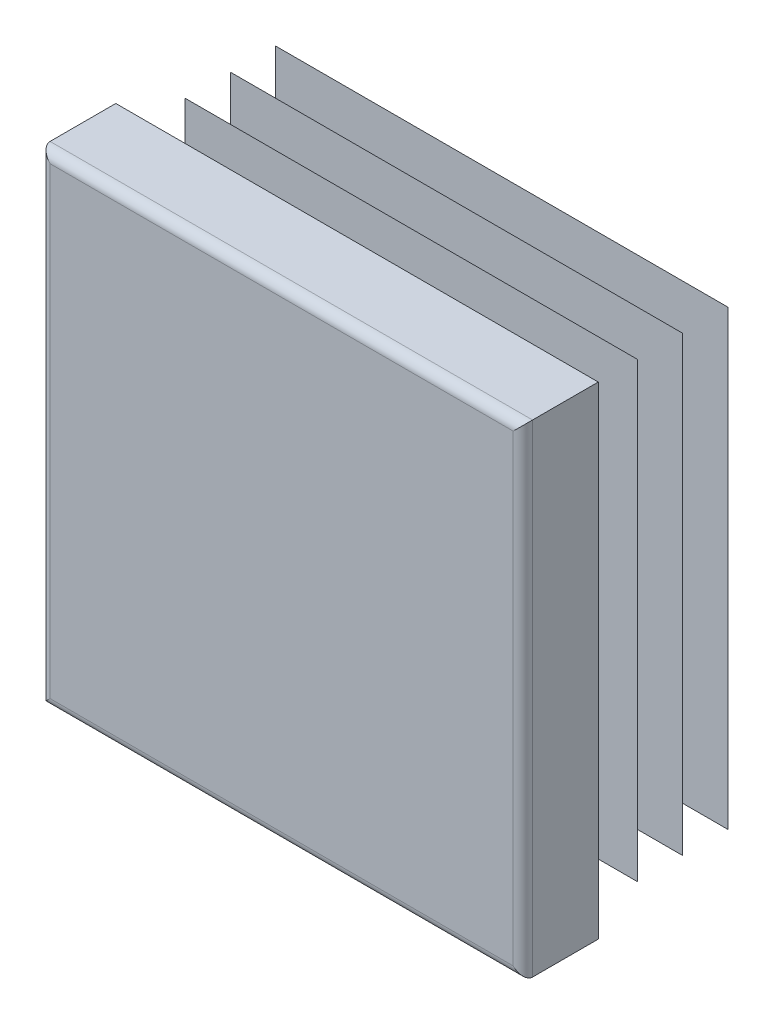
ISO-10303-21;
HEADER;
FILE_DESCRIPTION(('STEP AP214'),'2;1');
FILE_NAME('part.step','',(''),(''),'','','');
FILE_SCHEMA(('AUTOMOTIVE_DESIGN { 1 0 10303 214 1 1 1 1 }'));
ENDSEC;
DATA;
#1=APPLICATION_CONTEXT('core data for automotive mechanical design processes');
#2=APPLICATION_PROTOCOL_DEFINITION('international standard','automotive_design',2000,#1);
#3=PRODUCT_CONTEXT('',#1,'mechanical');
#4=PRODUCT('Part','Part','',(#3));
#5=PRODUCT_RELATED_PRODUCT_CATEGORY('part','',(#4));
#6=PRODUCT_DEFINITION_FORMATION('','',#4);
#7=PRODUCT_DEFINITION_CONTEXT('part definition',#1,'design');
#8=PRODUCT_DEFINITION('design','',#6,#7);
#9=PRODUCT_DEFINITION_SHAPE('','',#8);
#10=(LENGTH_UNIT() NAMED_UNIT(*) SI_UNIT(.MILLI.,.METRE.));
#11=(NAMED_UNIT(*) PLANE_ANGLE_UNIT() SI_UNIT($,.RADIAN.));
#12=(NAMED_UNIT(*) SI_UNIT($,.STERADIAN.) SOLID_ANGLE_UNIT());
#13=UNCERTAINTY_MEASURE_WITH_UNIT(LENGTH_MEASURE(1.E-05),#10,'distance_accuracy_value','');
#14=(GEOMETRIC_REPRESENTATION_CONTEXT(3) GLOBAL_UNCERTAINTY_ASSIGNED_CONTEXT((#13)) GLOBAL_UNIT_ASSIGNED_CONTEXT((#10,
#11,#12)) REPRESENTATION_CONTEXT('',''));
#15=CARTESIAN_POINT('',(0.,0.,0.));
#16=DIRECTION('',(0.,0.,1.));
#17=DIRECTION('',(1.,0.,0.));
#18=AXIS2_PLACEMENT_3D('',#15,#16,#17);
#19=CARTESIAN_POINT('',(15.36,-16.,5.));
#20=DIRECTION('',(0.,0.,-1.));
#21=DIRECTION('',(0.,1.,0.));
#22=AXIS2_PLACEMENT_3D('',#19,#20,#21);
#23=PLANE('',#22);
#24=DIRECTION('',(0.,1.,0.));
#25=VECTOR('',#24,1.);
#26=CARTESIAN_POINT('',(-15.36,-16.,5.));
#27=LINE('',#26,#25);
#28=CARTESIAN_POINT('',(-15.36,-15.36,5.));
#29=VERTEX_POINT('',#28);
#30=CARTESIAN_POINT('',(-15.36,15.36,5.));
#31=VERTEX_POINT('',#30);
#32=EDGE_CURVE('E262',#29,#31,#27,.T.);
#33=ORIENTED_EDGE('',*,*,#32,.F.);
#34=DIRECTION('',(-1.,0.,0.));
#35=VECTOR('',#34,1.);
#36=CARTESIAN_POINT('',(16.,-15.36,5.));
#37=LINE('',#36,#35);
#38=CARTESIAN_POINT('',(15.36,-15.36,5.));
#39=VERTEX_POINT('',#38);
#40=EDGE_CURVE('E432',#39,#29,#37,.T.);
#41=ORIENTED_EDGE('',*,*,#40,.F.);
#42=DIRECTION('',(0.,1.,0.));
#43=VECTOR('',#42,1.);
#44=CARTESIAN_POINT('',(15.36,-16.,5.));
#45=LINE('',#44,#43);
#46=CARTESIAN_POINT('',(15.36,15.36,5.));
#47=VERTEX_POINT('',#46);
#48=EDGE_CURVE('E257',#39,#47,#45,.T.);
#49=ORIENTED_EDGE('',*,*,#48,.T.);
#50=DIRECTION('',(-1.,0.,0.));
#51=VECTOR('',#50,1.);
#52=CARTESIAN_POINT('',(16.,15.36,5.));
#53=LINE('',#52,#51);
#54=EDGE_CURVE('E534',#47,#31,#53,.T.);
#55=ORIENTED_EDGE('',*,*,#54,.T.);
#56=EDGE_LOOP('',(#33,#41,#49,#55));
#57=FACE_BOUND('',#56,.T.);
#58=ADVANCED_FACE('F14',(#57),#23,.F.);
#59=CARTESIAN_POINT('',(-15.36,-16.,4.36));
#60=DIRECTION('',(0.,1.,0.));
#61=DIRECTION('',(-1.,0.,0.));
#62=AXIS2_PLACEMENT_3D('',#59,#60,#61);
#63=CYLINDRICAL_SURFACE('',#62,0.64);
#64=DIRECTION('',(0.,1.,0.));
#65=VECTOR('',#64,1.);
#66=CARTESIAN_POINT('',(-16.,-16.,4.36));
#67=LINE('',#66,#65);
#68=CARTESIAN_POINT('',(-16.,-16.,4.36));
#69=VERTEX_POINT('',#68);
#70=CARTESIAN_POINT('',(-16.,16.,4.36));
#71=VERTEX_POINT('',#70);
#72=EDGE_CURVE('E354',#69,#71,#67,.T.);
#73=ORIENTED_EDGE('',*,*,#72,.F.);
#74=CARTESIAN_POINT('',(-15.36,-15.36,4.36));
#75=DIRECTION('',(-0.707106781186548,0.707106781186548,0.));
#76=DIRECTION('',(0.707106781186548,0.707106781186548,0.));
#77=AXIS2_PLACEMENT_3D('',#74,#75,#76);
#78=ELLIPSE('',#77,0.905096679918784,0.64);
#79=EDGE_CURVE('E59',#69,#29,#78,.T.);
#80=ORIENTED_EDGE('',*,*,#79,.T.);
#81=ORIENTED_EDGE('',*,*,#32,.T.);
#82=CARTESIAN_POINT('',(-15.36,15.36,4.36));
#83=DIRECTION('',(0.707106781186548,0.707106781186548,0.));
#84=DIRECTION('',(-0.707106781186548,0.707106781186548,0.));
#85=AXIS2_PLACEMENT_3D('',#82,#83,#84);
#86=ELLIPSE('',#85,0.905096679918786,0.64);
#87=EDGE_CURVE('E258',#31,#71,#86,.F.);
#88=ORIENTED_EDGE('',*,*,#87,.T.);
#89=EDGE_LOOP('',(#73,#80,#81,#88));
#90=FACE_BOUND('',#89,.T.);
#91=ADVANCED_FACE('F16',(#90),#63,.T.);
#92=CARTESIAN_POINT('',(-16.,-16.,4.36));
#93=DIRECTION('',(1.,0.,0.));
#94=DIRECTION('',(0.,1.,0.));
#95=AXIS2_PLACEMENT_3D('',#92,#93,#94);
#96=PLANE('',#95);
#97=DIRECTION('',(0.,0.,-1.));
#98=VECTOR('',#97,1.);
#99=CARTESIAN_POINT('',(-16.,16.,4.36));
#100=LINE('',#99,#98);
#101=CARTESIAN_POINT('',(-16.,16.,0.));
#102=VERTEX_POINT('',#101);
#103=EDGE_CURVE('E519',#71,#102,#100,.T.);
#104=ORIENTED_EDGE('',*,*,#103,.T.);
#105=DIRECTION('',(0.,1.,0.));
#106=VECTOR('',#105,1.);
#107=CARTESIAN_POINT('',(-16.,-16.,0.));
#108=LINE('',#107,#106);
#109=CARTESIAN_POINT('',(-16.,-16.,0.));
#110=VERTEX_POINT('',#109);
#111=EDGE_CURVE('E352',#110,#102,#108,.T.);
#112=ORIENTED_EDGE('',*,*,#111,.F.);
#113=DIRECTION('',(0.,0.,-1.));
#114=VECTOR('',#113,1.);
#115=CARTESIAN_POINT('',(-16.,-16.,4.36));
#116=LINE('',#115,#114);
#117=EDGE_CURVE('E520',#69,#110,#116,.T.);
#118=ORIENTED_EDGE('',*,*,#117,.F.);
#119=ORIENTED_EDGE('',*,*,#72,.T.);
#120=EDGE_LOOP('',(#104,#112,#118,#119));
#121=FACE_BOUND('',#120,.T.);
#122=ADVANCED_FACE('F604',(#121),#96,.F.);
#123=CARTESIAN_POINT('',(-12.,-16.,0.));
#124=DIRECTION('',(1.,0.,0.));
#125=DIRECTION('',(0.,1.,0.));
#126=AXIS2_PLACEMENT_3D('',#123,#124,#125);
#127=PLANE('',#126);
#128=DIRECTION('',(0.,1.,0.));
#129=VECTOR('',#128,1.);
#130=CARTESIAN_POINT('',(-12.,-16.,0.));
#131=LINE('',#130,#129);
#132=CARTESIAN_POINT('',(-12.,-12.,0.));
#133=VERTEX_POINT('',#132);
#134=CARTESIAN_POINT('',(-12.,12.,0.));
#135=VERTEX_POINT('',#134);
#136=EDGE_CURVE('E349',#133,#135,#131,.T.);
#137=ORIENTED_EDGE('',*,*,#136,.T.);
#138=DIRECTION('',(0.,0.,-1.));
#139=VECTOR('',#138,1.);
#140=CARTESIAN_POINT('',(-12.,12.,0.));
#141=LINE('',#140,#139);
#142=CARTESIAN_POINT('',(-12.,12.,-0.6));
#143=VERTEX_POINT('',#142);
#144=EDGE_CURVE('E445',#135,#143,#141,.T.);
#145=ORIENTED_EDGE('',*,*,#144,.T.);
#146=DIRECTION('',(0.,1.,0.));
#147=VECTOR('',#146,1.);
#148=CARTESIAN_POINT('',(-12.,-16.,-0.6));
#149=LINE('',#148,#147);
#150=CARTESIAN_POINT('',(-12.,-12.,-0.6));
#151=VERTEX_POINT('',#150);
#152=EDGE_CURVE('E346',#151,#143,#149,.T.);
#153=ORIENTED_EDGE('',*,*,#152,.F.);
#154=DIRECTION('',(0.,0.,1.));
#155=VECTOR('',#154,1.);
#156=CARTESIAN_POINT('',(-12.,-12.,0.));
#157=LINE('',#156,#155);
#158=EDGE_CURVE('E439',#151,#133,#157,.T.);
#159=ORIENTED_EDGE('',*,*,#158,.T.);
#160=EDGE_LOOP('',(#137,#145,#153,#159));
#161=FACE_BOUND('',#160,.T.);
#162=ADVANCED_FACE('F728',(#161),#127,.F.);
#163=CARTESIAN_POINT('',(-15.,-16.,-0.6));
#164=DIRECTION('',(0.573576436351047,0.,0.819152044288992));
#165=DIRECTION('',(-0.819152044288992,0.,0.573576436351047));
#166=AXIS2_PLACEMENT_3D('',#163,#164,#165);
#167=PLANE('',#166);
#168=DIRECTION('',(0.,1.,0.));
#169=VECTOR('',#168,1.);
#170=CARTESIAN_POINT('',(-15.,-16.,-0.6));
#171=LINE('',#170,#169);
#172=CARTESIAN_POINT('',(-15.,-15.,-0.6));
#173=VERTEX_POINT('',#172);
#174=CARTESIAN_POINT('',(-15.,15.,-0.6));
#175=VERTEX_POINT('',#174);
#176=EDGE_CURVE('E344',#173,#175,#171,.T.);
#177=ORIENTED_EDGE('',*,*,#176,.T.);
#178=DIRECTION('',(0.633687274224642,-0.633687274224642,-0.443712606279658));
#179=VECTOR('',#178,1.);
#180=CARTESIAN_POINT('',(-2.55165359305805,2.55165359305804,-9.31642599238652));
#181=LINE('',#180,#179);
#182=CARTESIAN_POINT('',(-12.,12.,-2.70062261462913));
#183=VERTEX_POINT('',#182);
#184=EDGE_CURVE('E457',#175,#183,#181,.T.);
#185=ORIENTED_EDGE('',*,*,#184,.T.);
#186=DIRECTION('',(0.,1.,0.));
#187=VECTOR('',#186,1.);
#188=CARTESIAN_POINT('',(-12.,-16.,-2.70062261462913));
#189=LINE('',#188,#187);
#190=CARTESIAN_POINT('',(-12.,-12.,-2.70062261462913));
#191=VERTEX_POINT('',#190);
#192=EDGE_CURVE('E341',#191,#183,#189,.T.);
#193=ORIENTED_EDGE('',*,*,#192,.F.);
#194=DIRECTION('',(-0.633687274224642,-0.633687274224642,0.443712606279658));
#195=VECTOR('',#194,1.);
#196=CARTESIAN_POINT('',(-15.4015595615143,-15.4015595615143,-0.31882496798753));
#197=LINE('',#196,#195);
#198=EDGE_CURVE('E451',#191,#173,#197,.T.);
#199=ORIENTED_EDGE('',*,*,#198,.T.);
#200=EDGE_LOOP('',(#177,#185,#193,#199));
#201=FACE_BOUND('',#200,.T.);
#202=ADVANCED_FACE('F732',(#201),#167,.F.);
#203=CARTESIAN_POINT('',(-12.,-16.,-2.70062261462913));
#204=DIRECTION('',(1.,0.,0.));
#205=DIRECTION('',(0.,1.,0.));
#206=AXIS2_PLACEMENT_3D('',#203,#204,#205);
#207=PLANE('',#206);
#208=ORIENTED_EDGE('',*,*,#192,.T.);
#209=DIRECTION('',(0.,0.,-1.));
#210=VECTOR('',#209,1.);
#211=CARTESIAN_POINT('',(-12.,12.,-2.70062261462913));
#212=LINE('',#211,#210);
#213=CARTESIAN_POINT('',(-12.,12.,-3.6));
#214=VERTEX_POINT('',#213);
#215=EDGE_CURVE('E463',#183,#214,#212,.T.);
#216=ORIENTED_EDGE('',*,*,#215,.T.);
#217=DIRECTION('',(0.,1.,0.));
#218=VECTOR('',#217,1.);
#219=CARTESIAN_POINT('',(-12.,-16.,-3.6));
#220=LINE('',#219,#218);
#221=CARTESIAN_POINT('',(-12.,-12.,-3.6));
#222=VERTEX_POINT('',#221);
#223=EDGE_CURVE('E338',#222,#214,#220,.T.);
#224=ORIENTED_EDGE('',*,*,#223,.F.);
#225=DIRECTION('',(0.,0.,1.));
#226=VECTOR('',#225,1.);
#227=CARTESIAN_POINT('',(-12.,-12.,-2.70062261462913));
#228=LINE('',#227,#226);
#229=EDGE_CURVE('E460',#222,#191,#228,.T.);
#230=ORIENTED_EDGE('',*,*,#229,.T.);
#231=EDGE_LOOP('',(#208,#216,#224,#230));
#232=FACE_BOUND('',#231,.T.);
#233=ADVANCED_FACE('F738',(#232),#207,.F.);
#234=CARTESIAN_POINT('',(-15.,-16.,-3.6));
#235=DIRECTION('',(0.573576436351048,0.,0.819152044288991));
#236=DIRECTION('',(-0.819152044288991,0.,0.573576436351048));
#237=AXIS2_PLACEMENT_3D('',#234,#235,#236);
#238=PLANE('',#237);
#239=DIRECTION('',(0.,1.,0.));
#240=VECTOR('',#239,1.);
#241=CARTESIAN_POINT('',(-15.,-16.,-3.6));
#242=LINE('',#241,#240);
#243=CARTESIAN_POINT('',(-15.,-15.,-3.6));
#244=VERTEX_POINT('',#243);
#245=CARTESIAN_POINT('',(-15.,15.,-3.6));
#246=VERTEX_POINT('',#245);
#247=EDGE_CURVE('E336',#244,#246,#242,.T.);
#248=ORIENTED_EDGE('',*,*,#247,.T.);
#249=DIRECTION('',(0.633687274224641,-0.633687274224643,-0.443712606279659));
#250=VECTOR('',#249,1.);
#251=CARTESIAN_POINT('',(-2.55165359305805,2.55165359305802,-12.3164259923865));
#252=LINE('',#251,#250);
#253=CARTESIAN_POINT('',(-12.,12.,-5.70062261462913));
#254=VERTEX_POINT('',#253);
#255=EDGE_CURVE('E475',#246,#254,#252,.T.);
#256=ORIENTED_EDGE('',*,*,#255,.T.);
#257=DIRECTION('',(0.,1.,0.));
#258=VECTOR('',#257,1.);
#259=CARTESIAN_POINT('',(-12.,-16.,-5.70062261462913));
#260=LINE('',#259,#258);
#261=CARTESIAN_POINT('',(-12.,-12.,-5.70062261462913));
#262=VERTEX_POINT('',#261);
#263=EDGE_CURVE('E333',#262,#254,#260,.T.);
#264=ORIENTED_EDGE('',*,*,#263,.F.);
#265=DIRECTION('',(-0.633687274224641,-0.633687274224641,0.44371260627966));
#266=VECTOR('',#265,1.);
#267=CARTESIAN_POINT('',(-15.4015595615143,-15.4015595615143,-3.31882496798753));
#268=LINE('',#267,#266);
#269=EDGE_CURVE('E469',#262,#244,#268,.T.);
#270=ORIENTED_EDGE('',*,*,#269,.T.);
#271=EDGE_LOOP('',(#248,#256,#264,#270));
#272=FACE_BOUND('',#271,.T.);
#273=ADVANCED_FACE('F742',(#272),#238,.F.);
#274=CARTESIAN_POINT('',(-12.,-16.,-5.70062261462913));
#275=DIRECTION('',(1.,0.,0.));
#276=DIRECTION('',(0.,1.,0.));
#277=AXIS2_PLACEMENT_3D('',#274,#275,#276);
#278=PLANE('',#277);
#279=ORIENTED_EDGE('',*,*,#263,.T.);
#280=DIRECTION('',(0.,0.,-1.));
#281=VECTOR('',#280,1.);
#282=CARTESIAN_POINT('',(-12.,12.,-5.70062261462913));
#283=LINE('',#282,#281);
#284=CARTESIAN_POINT('',(-12.,12.,-6.6));
#285=VERTEX_POINT('',#284);
#286=EDGE_CURVE('E481',#254,#285,#283,.T.);
#287=ORIENTED_EDGE('',*,*,#286,.T.);
#288=DIRECTION('',(0.,1.,0.));
#289=VECTOR('',#288,1.);
#290=CARTESIAN_POINT('',(-12.,-16.,-6.6));
#291=LINE('',#290,#289);
#292=CARTESIAN_POINT('',(-12.,-12.,-6.6));
#293=VERTEX_POINT('',#292);
#294=EDGE_CURVE('E330',#293,#285,#291,.T.);
#295=ORIENTED_EDGE('',*,*,#294,.F.);
#296=DIRECTION('',(0.,0.,1.));
#297=VECTOR('',#296,1.);
#298=CARTESIAN_POINT('',(-12.,-12.,-5.70062261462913));
#299=LINE('',#298,#297);
#300=EDGE_CURVE('E478',#293,#262,#299,.T.);
#301=ORIENTED_EDGE('',*,*,#300,.T.);
#302=EDGE_LOOP('',(#279,#287,#295,#301));
#303=FACE_BOUND('',#302,.T.);
#304=ADVANCED_FACE('F746',(#303),#278,.F.);
#305=CARTESIAN_POINT('',(-15.,-16.,-6.6));
#306=DIRECTION('',(0.573576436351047,0.,0.819152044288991));
#307=DIRECTION('',(-0.819152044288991,0.,0.573576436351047));
#308=AXIS2_PLACEMENT_3D('',#305,#306,#307);
#309=PLANE('',#308);
#310=DIRECTION('',(0.,1.,0.));
#311=VECTOR('',#310,1.);
#312=CARTESIAN_POINT('',(-15.,-16.,-6.6));
#313=LINE('',#312,#311);
#314=CARTESIAN_POINT('',(-15.,-15.,-6.6));
#315=VERTEX_POINT('',#314);
#316=CARTESIAN_POINT('',(-15.,15.,-6.6));
#317=VERTEX_POINT('',#316);
#318=EDGE_CURVE('E328',#315,#317,#313,.T.);
#319=ORIENTED_EDGE('',*,*,#318,.T.);
#320=DIRECTION('',(0.633687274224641,-0.633687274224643,-0.443712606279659));
#321=VECTOR('',#320,1.);
#322=CARTESIAN_POINT('',(-2.55165359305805,2.55165359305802,-15.3164259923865));
#323=LINE('',#322,#321);
#324=CARTESIAN_POINT('',(-12.,12.,-8.70062261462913));
#325=VERTEX_POINT('',#324);
#326=EDGE_CURVE('E493',#317,#325,#323,.T.);
#327=ORIENTED_EDGE('',*,*,#326,.T.);
#328=DIRECTION('',(0.,1.,0.));
#329=VECTOR('',#328,1.);
#330=CARTESIAN_POINT('',(-12.,-16.,-8.70062261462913));
#331=LINE('',#330,#329);
#332=CARTESIAN_POINT('',(-12.,-12.,-8.70062261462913));
#333=VERTEX_POINT('',#332);
#334=EDGE_CURVE('E325',#333,#325,#331,.T.);
#335=ORIENTED_EDGE('',*,*,#334,.F.);
#336=DIRECTION('',(-0.633687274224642,-0.633687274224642,0.443712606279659));
#337=VECTOR('',#336,1.);
#338=CARTESIAN_POINT('',(-15.4015595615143,-15.4015595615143,-6.31882496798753));
#339=LINE('',#338,#337);
#340=EDGE_CURVE('E487',#333,#315,#339,.T.);
#341=ORIENTED_EDGE('',*,*,#340,.T.);
#342=EDGE_LOOP('',(#319,#327,#335,#341));
#343=FACE_BOUND('',#342,.T.);
#344=ADVANCED_FACE('F668',(#343),#309,.F.);
#345=CARTESIAN_POINT('',(-12.,-16.,-8.70062261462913));
#346=DIRECTION('',(1.,0.,0.));
#347=DIRECTION('',(0.,1.,0.));
#348=AXIS2_PLACEMENT_3D('',#345,#346,#347);
#349=PLANE('',#348);
#350=ORIENTED_EDGE('',*,*,#334,.T.);
#351=DIRECTION('',(0.,0.,-1.));
#352=VECTOR('',#351,1.);
#353=CARTESIAN_POINT('',(-12.,12.,-8.70062261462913));
#354=LINE('',#353,#352);
#355=CARTESIAN_POINT('',(-12.,12.,-9.6));
#356=VERTEX_POINT('',#355);
#357=EDGE_CURVE('E499',#325,#356,#354,.T.);
#358=ORIENTED_EDGE('',*,*,#357,.T.);
#359=DIRECTION('',(0.,1.,0.));
#360=VECTOR('',#359,1.);
#361=CARTESIAN_POINT('',(-12.,-16.,-9.6));
#362=LINE('',#361,#360);
#363=CARTESIAN_POINT('',(-12.,-12.,-9.6));
#364=VERTEX_POINT('',#363);
#365=EDGE_CURVE('E322',#364,#356,#362,.T.);
#366=ORIENTED_EDGE('',*,*,#365,.F.);
#367=DIRECTION('',(0.,0.,1.));
#368=VECTOR('',#367,1.);
#369=CARTESIAN_POINT('',(-12.,-12.,-8.70062261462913));
#370=LINE('',#369,#368);
#371=EDGE_CURVE('E496',#364,#333,#370,.T.);
#372=ORIENTED_EDGE('',*,*,#371,.T.);
#373=EDGE_LOOP('',(#350,#358,#366,#372));
#374=FACE_BOUND('',#373,.T.);
#375=ADVANCED_FACE('F665',(#374),#349,.F.);
#376=CARTESIAN_POINT('',(-15.,-16.,-9.6));
#377=DIRECTION('',(0.573576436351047,0.,0.819152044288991));
#378=DIRECTION('',(-0.819152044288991,0.,0.573576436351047));
#379=AXIS2_PLACEMENT_3D('',#376,#377,#378);
#380=PLANE('',#379);
#381=DIRECTION('',(0.,1.,0.));
#382=VECTOR('',#381,1.);
#383=CARTESIAN_POINT('',(-15.,-16.,-9.6));
#384=LINE('',#383,#382);
#385=CARTESIAN_POINT('',(-15.,-15.,-9.6));
#386=VERTEX_POINT('',#385);
#387=CARTESIAN_POINT('',(-15.,15.,-9.6));
#388=VERTEX_POINT('',#387);
#389=EDGE_CURVE('E320',#386,#388,#384,.T.);
#390=ORIENTED_EDGE('',*,*,#389,.T.);
#391=DIRECTION('',(0.633687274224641,-0.633687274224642,-0.443712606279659));
#392=VECTOR('',#391,1.);
#393=CARTESIAN_POINT('',(-2.55165359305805,2.55165359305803,-18.3164259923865));
#394=LINE('',#393,#392);
#395=CARTESIAN_POINT('',(-12.,12.,-11.7006226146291));
#396=VERTEX_POINT('',#395);
#397=EDGE_CURVE('E511',#388,#396,#394,.T.);
#398=ORIENTED_EDGE('',*,*,#397,.T.);
#399=DIRECTION('',(0.,1.,0.));
#400=VECTOR('',#399,1.);
#401=CARTESIAN_POINT('',(-12.,-16.,-11.7006226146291));
#402=LINE('',#401,#400);
#403=CARTESIAN_POINT('',(-12.,-12.,-11.7006226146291));
#404=VERTEX_POINT('',#403);
#405=EDGE_CURVE('E317',#404,#396,#402,.T.);
#406=ORIENTED_EDGE('',*,*,#405,.F.);
#407=DIRECTION('',(-0.633687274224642,-0.633687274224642,0.443712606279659));
#408=VECTOR('',#407,1.);
#409=CARTESIAN_POINT('',(-15.4015595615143,-15.4015595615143,-9.31882496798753));
#410=LINE('',#409,#408);
#411=EDGE_CURVE('E505',#404,#386,#410,.T.);
#412=ORIENTED_EDGE('',*,*,#411,.T.);
#413=EDGE_LOOP('',(#390,#398,#406,#412));
#414=FACE_BOUND('',#413,.T.);
#415=ADVANCED_FACE('F580',(#414),#380,.F.);
#416=CARTESIAN_POINT('',(-12.,-16.,-11.7006226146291));
#417=DIRECTION('',(1.,0.,0.));
#418=DIRECTION('',(0.,1.,0.));
#419=AXIS2_PLACEMENT_3D('',#416,#417,#418);
#420=PLANE('',#419);
#421=ORIENTED_EDGE('',*,*,#405,.T.);
#422=DIRECTION('',(0.,0.,-1.));
#423=VECTOR('',#422,1.);
#424=CARTESIAN_POINT('',(-12.,12.,-11.7006226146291));
#425=LINE('',#424,#423);
#426=CARTESIAN_POINT('',(-12.,12.,-12.));
#427=VERTEX_POINT('',#426);
#428=EDGE_CURVE('E517',#396,#427,#425,.T.);
#429=ORIENTED_EDGE('',*,*,#428,.T.);
#430=DIRECTION('',(0.,1.,0.));
#431=VECTOR('',#430,1.);
#432=CARTESIAN_POINT('',(-12.,-16.,-12.));
#433=LINE('',#432,#431);
#434=CARTESIAN_POINT('',(-12.,-12.,-12.));
#435=VERTEX_POINT('',#434);
#436=EDGE_CURVE('E314',#435,#427,#433,.T.);
#437=ORIENTED_EDGE('',*,*,#436,.F.);
#438=DIRECTION('',(0.,0.,1.));
#439=VECTOR('',#438,1.);
#440=CARTESIAN_POINT('',(-12.,-12.,-11.7006226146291));
#441=LINE('',#440,#439);
#442=EDGE_CURVE('E514',#435,#404,#441,.T.);
#443=ORIENTED_EDGE('',*,*,#442,.T.);
#444=EDGE_LOOP('',(#421,#429,#437,#443));
#445=FACE_BOUND('',#444,.T.);
#446=ADVANCED_FACE('F582',(#445),#420,.F.);
#447=CARTESIAN_POINT('',(-12.,-16.,-12.));
#448=DIRECTION('',(0.,0.,1.));
#449=DIRECTION('',(0.,-1.,0.));
#450=AXIS2_PLACEMENT_3D('',#447,#448,#449);
#451=PLANE('',#450);
#452=ORIENTED_EDGE('',*,*,#436,.T.);
#453=DIRECTION('',(-1.,0.,0.));
#454=VECTOR('',#453,1.);
#455=CARTESIAN_POINT('',(16.,12.,-12.));
#456=LINE('',#455,#454);
#457=CARTESIAN_POINT('',(12.,12.,-12.));
#458=VERTEX_POINT('',#457);
#459=EDGE_CURVE('E388',#458,#427,#456,.T.);
#460=ORIENTED_EDGE('',*,*,#459,.F.);
#461=DIRECTION('',(0.,1.,0.));
#462=VECTOR('',#461,1.);
#463=CARTESIAN_POINT('',(12.,-16.,-12.));
#464=LINE('',#463,#462);
#465=CARTESIAN_POINT('',(12.,-12.,-12.));
#466=VERTEX_POINT('',#465);
#467=EDGE_CURVE('E311',#466,#458,#464,.T.);
#468=ORIENTED_EDGE('',*,*,#467,.F.);
#469=DIRECTION('',(-1.,0.,0.));
#470=VECTOR('',#469,1.);
#471=CARTESIAN_POINT('',(16.,-12.,-12.));
#472=LINE('',#471,#470);
#473=EDGE_CURVE('E386',#466,#435,#472,.T.);
#474=ORIENTED_EDGE('',*,*,#473,.T.);
#475=EDGE_LOOP('',(#452,#460,#468,#474));
#476=FACE_BOUND('',#475,.T.);
#477=ADVANCED_FACE('F385',(#476),#451,.F.);
#478=CARTESIAN_POINT('',(12.,-16.,-12.));
#479=DIRECTION('',(-1.,0.,0.));
#480=DIRECTION('',(0.,-1.,0.));
#481=AXIS2_PLACEMENT_3D('',#478,#479,#480);
#482=PLANE('',#481);
#483=ORIENTED_EDGE('',*,*,#467,.T.);
#484=DIRECTION('',(0.,0.,1.));
#485=VECTOR('',#484,1.);
#486=CARTESIAN_POINT('',(12.,12.,-12.));
#487=LINE('',#486,#485);
#488=CARTESIAN_POINT('',(12.,12.,-11.7006226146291));
#489=VERTEX_POINT('',#488);
#490=EDGE_CURVE('E9',#458,#489,#487,.T.);
#491=ORIENTED_EDGE('',*,*,#490,.T.);
#492=DIRECTION('',(0.,1.,0.));
#493=VECTOR('',#492,1.);
#494=CARTESIAN_POINT('',(12.,-16.,-11.7006226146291));
#495=LINE('',#494,#493);
#496=CARTESIAN_POINT('',(12.,-12.,-11.7006226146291));
#497=VERTEX_POINT('',#496);
#498=EDGE_CURVE('E308',#497,#489,#495,.T.);
#499=ORIENTED_EDGE('',*,*,#498,.F.);
#500=DIRECTION('',(0.,0.,-1.));
#501=VECTOR('',#500,1.);
#502=CARTESIAN_POINT('',(12.,-12.,-12.));
#503=LINE('',#502,#501);
#504=EDGE_CURVE('E23',#497,#466,#503,.T.);
#505=ORIENTED_EDGE('',*,*,#504,.T.);
#506=EDGE_LOOP('',(#483,#491,#499,#505));
#507=FACE_BOUND('',#506,.T.);
#508=ADVANCED_FACE('F378',(#507),#482,.F.);
#509=CARTESIAN_POINT('',(12.,-16.,-11.7006226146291));
#510=DIRECTION('',(-0.573576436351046,0.,0.819152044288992));
#511=DIRECTION('',(-0.819152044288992,0.,-0.573576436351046));
#512=AXIS2_PLACEMENT_3D('',#509,#510,#511);
#513=PLANE('',#512);
#514=ORIENTED_EDGE('',*,*,#498,.T.);
#515=DIRECTION('',(0.633687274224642,0.633687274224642,0.443712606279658));
#516=VECTOR('',#515,1.);
#517=CARTESIAN_POINT('',(0.756332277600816,0.756332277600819,-19.5735235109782));
#518=LINE('',#517,#516);
#519=CARTESIAN_POINT('',(15.,15.,-9.6));
#520=VERTEX_POINT('',#519);
#521=EDGE_CURVE('E508',#489,#520,#518,.T.);
#522=ORIENTED_EDGE('',*,*,#521,.T.);
#523=DIRECTION('',(0.,1.,0.));
#524=VECTOR('',#523,1.);
#525=CARTESIAN_POINT('',(15.,-16.,-9.6));
#526=LINE('',#525,#524);
#527=CARTESIAN_POINT('',(15.,-15.,-9.6));
#528=VERTEX_POINT('',#527);
#529=EDGE_CURVE('E305',#528,#520,#526,.T.);
#530=ORIENTED_EDGE('',*,*,#529,.F.);
#531=DIRECTION('',(-0.633687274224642,0.633687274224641,-0.443712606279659));
#532=VECTOR('',#531,1.);
#533=CARTESIAN_POINT('',(13.606238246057,-13.606238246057,-10.5759224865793));
#534=LINE('',#533,#532);
#535=EDGE_CURVE('E502',#528,#497,#534,.T.);
#536=ORIENTED_EDGE('',*,*,#535,.T.);
#537=EDGE_LOOP('',(#514,#522,#530,#536));
#538=FACE_BOUND('',#537,.T.);
#539=ADVANCED_FACE('F588',(#538),#513,.F.);
#540=CARTESIAN_POINT('',(15.,-16.,-9.6));
#541=DIRECTION('',(0.,0.,-1.));
#542=DIRECTION('',(0.,1.,0.));
#543=AXIS2_PLACEMENT_3D('',#540,#541,#542);
#544=PLANE('',#543);
#545=ORIENTED_EDGE('',*,*,#529,.T.);
#546=DIRECTION('',(-1.,0.,0.));
#547=VECTOR('',#546,1.);
#548=CARTESIAN_POINT('',(16.,15.,-9.6));
#549=LINE('',#548,#547);
#550=EDGE_CURVE('E394',#520,#388,#549,.T.);
#551=ORIENTED_EDGE('',*,*,#550,.T.);
#552=ORIENTED_EDGE('',*,*,#389,.F.);
#553=DIRECTION('',(-1.,0.,0.));
#554=VECTOR('',#553,1.);
#555=CARTESIAN_POINT('',(16.,-15.,-9.6));
#556=LINE('',#555,#554);
#557=EDGE_CURVE('E401',#528,#386,#556,.T.);
#558=ORIENTED_EDGE('',*,*,#557,.F.);
#559=EDGE_LOOP('',(#545,#551,#552,#558));
#560=FACE_BOUND('',#559,.T.);
#561=ORIENTED_EDGE('',*,*,#365,.T.);
#562=DIRECTION('',(-1.,0.,0.));
#563=VECTOR('',#562,1.);
#564=CARTESIAN_POINT('',(16.,12.,-9.6));
#565=LINE('',#564,#563);
#566=CARTESIAN_POINT('',(12.,12.,-9.6));
#567=VERTEX_POINT('',#566);
#568=EDGE_CURVE('E567',#567,#356,#565,.T.);
#569=ORIENTED_EDGE('',*,*,#568,.F.);
#570=DIRECTION('',(0.,1.,0.));
#571=VECTOR('',#570,1.);
#572=CARTESIAN_POINT('',(12.,-16.,-9.6));
#573=LINE('',#572,#571);
#574=CARTESIAN_POINT('',(12.,-12.,-9.6));
#575=VERTEX_POINT('',#574);
#576=EDGE_CURVE('E302',#575,#567,#573,.T.);
#577=ORIENTED_EDGE('',*,*,#576,.F.);
#578=DIRECTION('',(-1.,0.,0.));
#579=VECTOR('',#578,1.);
#580=CARTESIAN_POINT('',(16.,-12.,-9.6));
#581=LINE('',#580,#579);
#582=EDGE_CURVE('E403',#575,#364,#581,.T.);
#583=ORIENTED_EDGE('',*,*,#582,.T.);
#584=EDGE_LOOP('',(#561,#569,#577,#583));
#585=FACE_BOUND('',#584,.T.);
#586=ADVANCED_FACE('F571',(#560,#585),#544,.F.);
#587=CARTESIAN_POINT('',(12.,-16.,-9.6));
#588=DIRECTION('',(-1.,0.,0.));
#589=DIRECTION('',(0.,-1.,0.));
#590=AXIS2_PLACEMENT_3D('',#587,#588,#589);
#591=PLANE('',#590);
#592=ORIENTED_EDGE('',*,*,#576,.T.);
#593=DIRECTION('',(0.,0.,1.));
#594=VECTOR('',#593,1.);
#595=CARTESIAN_POINT('',(12.,12.,-9.6));
#596=LINE('',#595,#594);
#597=CARTESIAN_POINT('',(12.,12.,-8.70062261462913));
#598=VERTEX_POINT('',#597);
#599=EDGE_CURVE('E372',#567,#598,#596,.T.);
#600=ORIENTED_EDGE('',*,*,#599,.T.);
#601=DIRECTION('',(0.,1.,0.));
#602=VECTOR('',#601,1.);
#603=CARTESIAN_POINT('',(12.,-16.,-8.70062261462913));
#604=LINE('',#603,#602);
#605=CARTESIAN_POINT('',(12.,-12.,-8.70062261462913));
#606=VERTEX_POINT('',#605);
#607=EDGE_CURVE('E299',#606,#598,#604,.T.);
#608=ORIENTED_EDGE('',*,*,#607,.F.);
#609=DIRECTION('',(0.,0.,-1.));
#610=VECTOR('',#609,1.);
#611=CARTESIAN_POINT('',(12.,-12.,-9.6));
#612=LINE('',#611,#610);
#613=EDGE_CURVE('E369',#606,#575,#612,.T.);
#614=ORIENTED_EDGE('',*,*,#613,.T.);
#615=EDGE_LOOP('',(#592,#600,#608,#614));
#616=FACE_BOUND('',#615,.T.);
#617=ADVANCED_FACE('F596',(#616),#591,.F.);
#618=CARTESIAN_POINT('',(12.,-16.,-8.70062261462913));
#619=DIRECTION('',(-0.573576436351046,0.,0.819152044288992));
#620=DIRECTION('',(-0.819152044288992,0.,-0.573576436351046));
#621=AXIS2_PLACEMENT_3D('',#618,#619,#620);
#622=PLANE('',#621);
#623=ORIENTED_EDGE('',*,*,#607,.T.);
#624=DIRECTION('',(0.633687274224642,0.633687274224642,0.443712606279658));
#625=VECTOR('',#624,1.);
#626=CARTESIAN_POINT('',(0.756332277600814,0.756332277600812,-16.5735235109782));
#627=LINE('',#626,#625);
#628=CARTESIAN_POINT('',(15.,15.,-6.6));
#629=VERTEX_POINT('',#628);
#630=EDGE_CURVE('E490',#598,#629,#627,.T.);
#631=ORIENTED_EDGE('',*,*,#630,.T.);
#632=DIRECTION('',(0.,1.,0.));
#633=VECTOR('',#632,1.);
#634=CARTESIAN_POINT('',(15.,-16.,-6.6));
#635=LINE('',#634,#633);
#636=CARTESIAN_POINT('',(15.,-15.,-6.6));
#637=VERTEX_POINT('',#636);
#638=EDGE_CURVE('E296',#637,#629,#635,.T.);
#639=ORIENTED_EDGE('',*,*,#638,.F.);
#640=DIRECTION('',(-0.633687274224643,0.633687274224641,-0.443712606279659));
#641=VECTOR('',#640,1.);
#642=CARTESIAN_POINT('',(13.606238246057,-13.606238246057,-7.57592248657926));
#643=LINE('',#642,#641);
#644=EDGE_CURVE('E484',#637,#606,#643,.T.);
#645=ORIENTED_EDGE('',*,*,#644,.T.);
#646=EDGE_LOOP('',(#623,#631,#639,#645));
#647=FACE_BOUND('',#646,.T.);
#648=ADVANCED_FACE('F648',(#647),#622,.F.);
#649=CARTESIAN_POINT('',(15.,-16.,-6.6));
#650=DIRECTION('',(0.,0.,-1.));
#651=DIRECTION('',(0.,1.,0.));
#652=AXIS2_PLACEMENT_3D('',#649,#650,#651);
#653=PLANE('',#652);
#654=ORIENTED_EDGE('',*,*,#638,.T.);
#655=DIRECTION('',(-1.,0.,0.));
#656=VECTOR('',#655,1.);
#657=CARTESIAN_POINT('',(16.,15.,-6.6));
#658=LINE('',#657,#656);
#659=EDGE_CURVE('E561',#629,#317,#658,.T.);
#660=ORIENTED_EDGE('',*,*,#659,.T.);
#661=ORIENTED_EDGE('',*,*,#318,.F.);
#662=DIRECTION('',(-1.,0.,0.));
#663=VECTOR('',#662,1.);
#664=CARTESIAN_POINT('',(16.,-15.,-6.6));
#665=LINE('',#664,#663);
#666=EDGE_CURVE('E409',#637,#315,#665,.T.);
#667=ORIENTED_EDGE('',*,*,#666,.F.);
#668=EDGE_LOOP('',(#654,#660,#661,#667));
#669=FACE_BOUND('',#668,.T.);
#670=ORIENTED_EDGE('',*,*,#294,.T.);
#671=DIRECTION('',(-1.,0.,0.));
#672=VECTOR('',#671,1.);
#673=CARTESIAN_POINT('',(16.,12.,-6.6));
#674=LINE('',#673,#672);
#675=CARTESIAN_POINT('',(12.,12.,-6.6));
#676=VERTEX_POINT('',#675);
#677=EDGE_CURVE('E559',#676,#285,#674,.T.);
#678=ORIENTED_EDGE('',*,*,#677,.F.);
#679=DIRECTION('',(0.,1.,0.));
#680=VECTOR('',#679,1.);
#681=CARTESIAN_POINT('',(12.,-16.,-6.6));
#682=LINE('',#681,#680);
#683=CARTESIAN_POINT('',(12.,-12.,-6.6));
#684=VERTEX_POINT('',#683);
#685=EDGE_CURVE('E293',#684,#676,#682,.T.);
#686=ORIENTED_EDGE('',*,*,#685,.F.);
#687=DIRECTION('',(-1.,0.,0.));
#688=VECTOR('',#687,1.);
#689=CARTESIAN_POINT('',(16.,-12.,-6.6));
#690=LINE('',#689,#688);
#691=EDGE_CURVE('E411',#684,#293,#690,.T.);
#692=ORIENTED_EDGE('',*,*,#691,.T.);
#693=EDGE_LOOP('',(#670,#678,#686,#692));
#694=FACE_BOUND('',#693,.T.);
#695=ADVANCED_FACE('F644',(#669,#694),#653,.F.);
#696=CARTESIAN_POINT('',(12.,-16.,-6.6));
#697=DIRECTION('',(-1.,0.,0.));
#698=DIRECTION('',(0.,-1.,0.));
#699=AXIS2_PLACEMENT_3D('',#696,#697,#698);
#700=PLANE('',#699);
#701=ORIENTED_EDGE('',*,*,#685,.T.);
#702=DIRECTION('',(0.,0.,1.));
#703=VECTOR('',#702,1.);
#704=CARTESIAN_POINT('',(12.,12.,-6.6));
#705=LINE('',#704,#703);
#706=CARTESIAN_POINT('',(12.,12.,-5.70062261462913));
#707=VERTEX_POINT('',#706);
#708=EDGE_CURVE('E366',#676,#707,#705,.T.);
#709=ORIENTED_EDGE('',*,*,#708,.T.);
#710=DIRECTION('',(0.,1.,0.));
#711=VECTOR('',#710,1.);
#712=CARTESIAN_POINT('',(12.,-16.,-5.70062261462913));
#713=LINE('',#712,#711);
#714=CARTESIAN_POINT('',(12.,-12.,-5.70062261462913));
#715=VERTEX_POINT('',#714);
#716=EDGE_CURVE('E290',#715,#707,#713,.T.);
#717=ORIENTED_EDGE('',*,*,#716,.F.);
#718=DIRECTION('',(0.,0.,-1.));
#719=VECTOR('',#718,1.);
#720=CARTESIAN_POINT('',(12.,-12.,-6.6));
#721=LINE('',#720,#719);
#722=EDGE_CURVE('E363',#715,#684,#721,.T.);
#723=ORIENTED_EDGE('',*,*,#722,.T.);
#724=EDGE_LOOP('',(#701,#709,#717,#723));
#725=FACE_BOUND('',#724,.T.);
#726=ADVANCED_FACE('F640',(#725),#700,.F.);
#727=CARTESIAN_POINT('',(12.,-16.,-5.70062261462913));
#728=DIRECTION('',(-0.573576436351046,0.,0.819152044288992));
#729=DIRECTION('',(-0.819152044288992,0.,-0.573576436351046));
#730=AXIS2_PLACEMENT_3D('',#727,#728,#729);
#731=PLANE('',#730);
#732=ORIENTED_EDGE('',*,*,#716,.T.);
#733=DIRECTION('',(0.633687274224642,0.633687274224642,0.443712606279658));
#734=VECTOR('',#733,1.);
#735=CARTESIAN_POINT('',(0.756332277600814,0.756332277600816,-13.5735235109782));
#736=LINE('',#735,#734);
#737=CARTESIAN_POINT('',(15.,15.,-3.6));
#738=VERTEX_POINT('',#737);
#739=EDGE_CURVE('E472',#707,#738,#736,.T.);
#740=ORIENTED_EDGE('',*,*,#739,.T.);
#741=DIRECTION('',(0.,1.,0.));
#742=VECTOR('',#741,1.);
#743=CARTESIAN_POINT('',(15.,-16.,-3.6));
#744=LINE('',#743,#742);
#745=CARTESIAN_POINT('',(15.,-15.,-3.6));
#746=VERTEX_POINT('',#745);
#747=EDGE_CURVE('E287',#746,#738,#744,.T.);
#748=ORIENTED_EDGE('',*,*,#747,.F.);
#749=DIRECTION('',(-0.633687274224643,0.633687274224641,-0.443712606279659));
#750=VECTOR('',#749,1.);
#751=CARTESIAN_POINT('',(13.606238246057,-13.606238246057,-4.57592248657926));
#752=LINE('',#751,#750);
#753=EDGE_CURVE('E466',#746,#715,#752,.T.);
#754=ORIENTED_EDGE('',*,*,#753,.T.);
#755=EDGE_LOOP('',(#732,#740,#748,#754));
#756=FACE_BOUND('',#755,.T.);
#757=ADVANCED_FACE('F636',(#756),#731,.F.);
#758=CARTESIAN_POINT('',(15.,-16.,-3.6));
#759=DIRECTION('',(0.,0.,-1.));
#760=DIRECTION('',(0.,1.,0.));
#761=AXIS2_PLACEMENT_3D('',#758,#759,#760);
#762=PLANE('',#761);
#763=ORIENTED_EDGE('',*,*,#747,.T.);
#764=DIRECTION('',(-1.,0.,0.));
#765=VECTOR('',#764,1.);
#766=CARTESIAN_POINT('',(16.,15.,-3.6));
#767=LINE('',#766,#765);
#768=EDGE_CURVE('E553',#738,#246,#767,.T.);
#769=ORIENTED_EDGE('',*,*,#768,.T.);
#770=ORIENTED_EDGE('',*,*,#247,.F.);
#771=DIRECTION('',(-1.,0.,0.));
#772=VECTOR('',#771,1.);
#773=CARTESIAN_POINT('',(16.,-15.,-3.6));
#774=LINE('',#773,#772);
#775=EDGE_CURVE('E417',#746,#244,#774,.T.);
#776=ORIENTED_EDGE('',*,*,#775,.F.);
#777=EDGE_LOOP('',(#763,#769,#770,#776));
#778=FACE_BOUND('',#777,.T.);
#779=ORIENTED_EDGE('',*,*,#223,.T.);
#780=DIRECTION('',(-1.,0.,0.));
#781=VECTOR('',#780,1.);
#782=CARTESIAN_POINT('',(16.,12.,-3.6));
#783=LINE('',#782,#781);
#784=CARTESIAN_POINT('',(12.,12.,-3.6));
#785=VERTEX_POINT('',#784);
#786=EDGE_CURVE('E551',#785,#214,#783,.T.);
#787=ORIENTED_EDGE('',*,*,#786,.F.);
#788=DIRECTION('',(0.,1.,0.));
#789=VECTOR('',#788,1.);
#790=CARTESIAN_POINT('',(12.,-16.,-3.6));
#791=LINE('',#790,#789);
#792=CARTESIAN_POINT('',(12.,-12.,-3.6));
#793=VERTEX_POINT('',#792);
#794=EDGE_CURVE('E284',#793,#785,#791,.T.);
#795=ORIENTED_EDGE('',*,*,#794,.F.);
#796=DIRECTION('',(-1.,0.,0.));
#797=VECTOR('',#796,1.);
#798=CARTESIAN_POINT('',(16.,-12.,-3.6));
#799=LINE('',#798,#797);
#800=EDGE_CURVE('E419',#793,#222,#799,.T.);
#801=ORIENTED_EDGE('',*,*,#800,.T.);
#802=EDGE_LOOP('',(#779,#787,#795,#801));
#803=FACE_BOUND('',#802,.T.);
#804=ADVANCED_FACE('F632',(#778,#803),#762,.F.);
#805=CARTESIAN_POINT('',(12.,-16.,-3.6));
#806=DIRECTION('',(-1.,0.,0.));
#807=DIRECTION('',(0.,-1.,0.));
#808=AXIS2_PLACEMENT_3D('',#805,#806,#807);
#809=PLANE('',#808);
#810=ORIENTED_EDGE('',*,*,#794,.T.);
#811=DIRECTION('',(0.,0.,1.));
#812=VECTOR('',#811,1.);
#813=CARTESIAN_POINT('',(12.,12.,-3.6));
#814=LINE('',#813,#812);
#815=CARTESIAN_POINT('',(12.,12.,-2.70062261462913));
#816=VERTEX_POINT('',#815);
#817=EDGE_CURVE('E360',#785,#816,#814,.T.);
#818=ORIENTED_EDGE('',*,*,#817,.T.);
#819=DIRECTION('',(0.,1.,0.));
#820=VECTOR('',#819,1.);
#821=CARTESIAN_POINT('',(12.,-16.,-2.70062261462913));
#822=LINE('',#821,#820);
#823=CARTESIAN_POINT('',(12.,-12.,-2.70062261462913));
#824=VERTEX_POINT('',#823);
#825=EDGE_CURVE('E281',#824,#816,#822,.T.);
#826=ORIENTED_EDGE('',*,*,#825,.F.);
#827=DIRECTION('',(0.,0.,-1.));
#828=VECTOR('',#827,1.);
#829=CARTESIAN_POINT('',(12.,-12.,-3.6));
#830=LINE('',#829,#828);
#831=EDGE_CURVE('E357',#824,#793,#830,.T.);
#832=ORIENTED_EDGE('',*,*,#831,.T.);
#833=EDGE_LOOP('',(#810,#818,#826,#832));
#834=FACE_BOUND('',#833,.T.);
#835=ADVANCED_FACE('F628',(#834),#809,.F.);
#836=CARTESIAN_POINT('',(12.,-16.,-2.70062261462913));
#837=DIRECTION('',(-0.573576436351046,0.,0.819152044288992));
#838=DIRECTION('',(-0.819152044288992,0.,-0.573576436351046));
#839=AXIS2_PLACEMENT_3D('',#836,#837,#838);
#840=PLANE('',#839);
#841=ORIENTED_EDGE('',*,*,#825,.T.);
#842=DIRECTION('',(0.633687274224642,0.633687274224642,0.443712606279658));
#843=VECTOR('',#842,1.);
#844=CARTESIAN_POINT('',(0.756332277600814,0.756332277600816,-10.5735235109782));
#845=LINE('',#844,#843);
#846=CARTESIAN_POINT('',(15.,15.,-0.6));
#847=VERTEX_POINT('',#846);
#848=EDGE_CURVE('E454',#816,#847,#845,.T.);
#849=ORIENTED_EDGE('',*,*,#848,.T.);
#850=DIRECTION('',(0.,1.,0.));
#851=VECTOR('',#850,1.);
#852=CARTESIAN_POINT('',(15.,-16.,-0.6));
#853=LINE('',#852,#851);
#854=CARTESIAN_POINT('',(15.,-15.,-0.6));
#855=VERTEX_POINT('',#854);
#856=EDGE_CURVE('E278',#855,#847,#853,.T.);
#857=ORIENTED_EDGE('',*,*,#856,.F.);
#858=DIRECTION('',(-0.633687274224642,0.633687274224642,-0.443712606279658));
#859=VECTOR('',#858,1.);
#860=CARTESIAN_POINT('',(13.606238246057,-13.606238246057,-1.57592248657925));
#861=LINE('',#860,#859);
#862=EDGE_CURVE('E448',#855,#824,#861,.T.);
#863=ORIENTED_EDGE('',*,*,#862,.T.);
#864=EDGE_LOOP('',(#841,#849,#857,#863));
#865=FACE_BOUND('',#864,.T.);
#866=ADVANCED_FACE('F624',(#865),#840,.F.);
#867=CARTESIAN_POINT('',(15.,-16.,-0.6));
#868=DIRECTION('',(0.,0.,-1.));
#869=DIRECTION('',(0.,1.,0.));
#870=AXIS2_PLACEMENT_3D('',#867,#868,#869);
#871=PLANE('',#870);
#872=ORIENTED_EDGE('',*,*,#856,.T.);
#873=DIRECTION('',(-1.,0.,0.));
#874=VECTOR('',#873,1.);
#875=CARTESIAN_POINT('',(16.,15.,-0.6));
#876=LINE('',#875,#874);
#877=EDGE_CURVE('E545',#847,#175,#876,.T.);
#878=ORIENTED_EDGE('',*,*,#877,.T.);
#879=ORIENTED_EDGE('',*,*,#176,.F.);
#880=DIRECTION('',(-1.,0.,0.));
#881=VECTOR('',#880,1.);
#882=CARTESIAN_POINT('',(16.,-15.,-0.6));
#883=LINE('',#882,#881);
#884=EDGE_CURVE('E425',#855,#173,#883,.T.);
#885=ORIENTED_EDGE('',*,*,#884,.F.);
#886=EDGE_LOOP('',(#872,#878,#879,#885));
#887=FACE_BOUND('',#886,.T.);
#888=ORIENTED_EDGE('',*,*,#152,.T.);
#889=DIRECTION('',(-1.,0.,0.));
#890=VECTOR('',#889,1.);
#891=CARTESIAN_POINT('',(16.,12.,-0.6));
#892=LINE('',#891,#890);
#893=CARTESIAN_POINT('',(12.,12.,-0.6));
#894=VERTEX_POINT('',#893);
#895=EDGE_CURVE('E543',#894,#143,#892,.T.);
#896=ORIENTED_EDGE('',*,*,#895,.F.);
#897=DIRECTION('',(0.,1.,0.));
#898=VECTOR('',#897,1.);
#899=CARTESIAN_POINT('',(12.,-16.,-0.6));
#900=LINE('',#899,#898);
#901=CARTESIAN_POINT('',(12.,-12.,-0.6));
#902=VERTEX_POINT('',#901);
#903=EDGE_CURVE('E275',#902,#894,#900,.T.);
#904=ORIENTED_EDGE('',*,*,#903,.F.);
#905=DIRECTION('',(-1.,0.,0.));
#906=VECTOR('',#905,1.);
#907=CARTESIAN_POINT('',(16.,-12.,-0.6));
#908=LINE('',#907,#906);
#909=EDGE_CURVE('E427',#902,#151,#908,.T.);
#910=ORIENTED_EDGE('',*,*,#909,.T.);
#911=EDGE_LOOP('',(#888,#896,#904,#910));
#912=FACE_BOUND('',#911,.T.);
#913=ADVANCED_FACE('F620',(#887,#912),#871,.F.);
#914=CARTESIAN_POINT('',(12.,-16.,-0.6));
#915=DIRECTION('',(-1.,0.,0.));
#916=DIRECTION('',(0.,-1.,0.));
#917=AXIS2_PLACEMENT_3D('',#914,#915,#916);
#918=PLANE('',#917);
#919=ORIENTED_EDGE('',*,*,#903,.T.);
#920=DIRECTION('',(0.,0.,1.));
#921=VECTOR('',#920,1.);
#922=CARTESIAN_POINT('',(12.,12.,-0.6));
#923=LINE('',#922,#921);
#924=CARTESIAN_POINT('',(12.,12.,0.));
#925=VERTEX_POINT('',#924);
#926=EDGE_CURVE('E442',#894,#925,#923,.T.);
#927=ORIENTED_EDGE('',*,*,#926,.T.);
#928=DIRECTION('',(0.,1.,0.));
#929=VECTOR('',#928,1.);
#930=CARTESIAN_POINT('',(12.,-16.,0.));
#931=LINE('',#930,#929);
#932=CARTESIAN_POINT('',(12.,-12.,0.));
#933=VERTEX_POINT('',#932);
#934=EDGE_CURVE('E268',#933,#925,#931,.T.);
#935=ORIENTED_EDGE('',*,*,#934,.F.);
#936=DIRECTION('',(0.,0.,-1.));
#937=VECTOR('',#936,1.);
#938=CARTESIAN_POINT('',(12.,-12.,-0.6));
#939=LINE('',#938,#937);
#940=EDGE_CURVE('E436',#933,#902,#939,.T.);
#941=ORIENTED_EDGE('',*,*,#940,.T.);
#942=EDGE_LOOP('',(#919,#927,#935,#941));
#943=FACE_BOUND('',#942,.T.);
#944=ADVANCED_FACE('F616',(#943),#918,.F.);
#945=CARTESIAN_POINT('',(12.,-16.,0.));
#946=DIRECTION('',(0.,0.,1.));
#947=DIRECTION('',(0.,-1.,0.));
#948=AXIS2_PLACEMENT_3D('',#945,#946,#947);
#949=PLANE('',#948);
#950=DIRECTION('',(-1.,0.,0.));
#951=VECTOR('',#950,1.);
#952=CARTESIAN_POINT('',(16.,12.,0.));
#953=LINE('',#952,#951);
#954=EDGE_CURVE('E538',#925,#135,#953,.T.);
#955=ORIENTED_EDGE('',*,*,#954,.T.);
#956=ORIENTED_EDGE('',*,*,#136,.F.);
#957=DIRECTION('',(-1.,0.,0.));
#958=VECTOR('',#957,1.);
#959=CARTESIAN_POINT('',(16.,-12.,0.));
#960=LINE('',#959,#958);
#961=EDGE_CURVE('E248',#933,#133,#960,.T.);
#962=ORIENTED_EDGE('',*,*,#961,.F.);
#963=ORIENTED_EDGE('',*,*,#934,.T.);
#964=EDGE_LOOP('',(#955,#956,#962,#963));
#965=FACE_BOUND('',#964,.T.);
#966=ORIENTED_EDGE('',*,*,#111,.T.);
#967=DIRECTION('',(1.,0.,0.));
#968=VECTOR('',#967,1.);
#969=CARTESIAN_POINT('',(12.,16.,0.));
#970=LINE('',#969,#968);
#971=CARTESIAN_POINT('',(16.,16.,0.));
#972=VERTEX_POINT('',#971);
#973=EDGE_CURVE('E525',#102,#972,#970,.T.);
#974=ORIENTED_EDGE('',*,*,#973,.T.);
#975=DIRECTION('',(0.,1.,0.));
#976=VECTOR('',#975,1.);
#977=CARTESIAN_POINT('',(16.,-16.,0.));
#978=LINE('',#977,#976);
#979=CARTESIAN_POINT('',(16.,-16.,0.));
#980=VERTEX_POINT('',#979);
#981=EDGE_CURVE('E45',#980,#972,#978,.T.);
#982=ORIENTED_EDGE('',*,*,#981,.F.);
#983=DIRECTION('',(1.,0.,0.));
#984=VECTOR('',#983,1.);
#985=CARTESIAN_POINT('',(-16.,-16.,0.));
#986=LINE('',#985,#984);
#987=EDGE_CURVE('E31',#110,#980,#986,.T.);
#988=ORIENTED_EDGE('',*,*,#987,.F.);
#989=EDGE_LOOP('',(#966,#974,#982,#988));
#990=FACE_BOUND('',#989,.T.);
#991=ADVANCED_FACE('F613',(#965,#990),#949,.F.);
#992=CARTESIAN_POINT('',(16.,-16.,0.));
#993=DIRECTION('',(-1.,0.,0.));
#994=DIRECTION('',(0.,-1.,0.));
#995=AXIS2_PLACEMENT_3D('',#992,#993,#994);
#996=PLANE('',#995);
#997=DIRECTION('',(0.,0.,1.));
#998=VECTOR('',#997,1.);
#999=CARTESIAN_POINT('',(16.,16.,0.));
#1000=LINE('',#999,#998);
#1001=CARTESIAN_POINT('',(16.,16.,4.36));
#1002=VERTEX_POINT('',#1001);
#1003=EDGE_CURVE('E266',#972,#1002,#1000,.T.);
#1004=ORIENTED_EDGE('',*,*,#1003,.T.);
#1005=DIRECTION('',(0.,1.,0.));
#1006=VECTOR('',#1005,1.);
#1007=CARTESIAN_POINT('',(16.,-16.,4.36));
#1008=LINE('',#1007,#1006);
#1009=CARTESIAN_POINT('',(16.,-16.,4.36));
#1010=VERTEX_POINT('',#1009);
#1011=EDGE_CURVE('E255',#1010,#1002,#1008,.T.);
#1012=ORIENTED_EDGE('',*,*,#1011,.F.);
#1013=DIRECTION('',(0.,0.,1.));
#1014=VECTOR('',#1013,1.);
#1015=CARTESIAN_POINT('',(16.,-16.,0.));
#1016=LINE('',#1015,#1014);
#1017=EDGE_CURVE('E260',#980,#1010,#1016,.T.);
#1018=ORIENTED_EDGE('',*,*,#1017,.F.);
#1019=ORIENTED_EDGE('',*,*,#981,.T.);
#1020=EDGE_LOOP('',(#1004,#1012,#1018,#1019));
#1021=FACE_BOUND('',#1020,.T.);
#1022=ADVANCED_FACE('F264',(#1021),#996,.F.);
#1023=CARTESIAN_POINT('',(15.36,-16.,4.36));
#1024=DIRECTION('',(0.,1.,0.));
#1025=DIRECTION('',(-1.,0.,0.));
#1026=AXIS2_PLACEMENT_3D('',#1023,#1024,#1025);
#1027=CYLINDRICAL_SURFACE('',#1026,0.64);
#1028=ORIENTED_EDGE('',*,*,#48,.F.);
#1029=CARTESIAN_POINT('',(15.36,-15.36,4.36));
#1030=DIRECTION('',(0.707106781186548,0.707106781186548,0.));
#1031=DIRECTION('',(-0.707106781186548,0.707106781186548,0.));
#1032=AXIS2_PLACEMENT_3D('',#1029,#1030,#1031);
#1033=ELLIPSE('',#1032,0.905096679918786,0.64);
#1034=EDGE_CURVE('E245',#39,#1010,#1033,.T.);
#1035=ORIENTED_EDGE('',*,*,#1034,.T.);
#1036=ORIENTED_EDGE('',*,*,#1011,.T.);
#1037=CARTESIAN_POINT('',(15.36,15.36,4.36));
#1038=DIRECTION('',(-0.707106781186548,0.707106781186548,0.));
#1039=DIRECTION('',(0.707106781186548,0.707106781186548,0.));
#1040=AXIS2_PLACEMENT_3D('',#1037,#1038,#1039);
#1041=ELLIPSE('',#1040,0.905096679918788,0.64);
#1042=EDGE_CURVE('E52',#1002,#47,#1041,.F.);
#1043=ORIENTED_EDGE('',*,*,#1042,.T.);
#1044=EDGE_LOOP('',(#1028,#1035,#1036,#1043));
#1045=FACE_BOUND('',#1044,.T.);
#1046=ADVANCED_FACE('F253',(#1045),#1027,.T.);
#1047=CARTESIAN_POINT('',(-15.36,-16.,4.36));
#1048=DIRECTION('',(0.,-1.,0.));
#1049=DIRECTION('',(1.,0.,0.));
#1050=AXIS2_PLACEMENT_3D('',#1047,#1048,#1049);
#1051=PLANE('',#1050);
#1052=DIRECTION('',(-1.,0.,0.));
#1053=VECTOR('',#1052,1.);
#1054=CARTESIAN_POINT('',(16.,-16.,4.36));
#1055=LINE('',#1054,#1053);
#1056=EDGE_CURVE('E242',#1010,#69,#1055,.T.);
#1057=ORIENTED_EDGE('',*,*,#1056,.T.);
#1058=ORIENTED_EDGE('',*,*,#117,.T.);
#1059=ORIENTED_EDGE('',*,*,#987,.T.);
#1060=ORIENTED_EDGE('',*,*,#1017,.T.);
#1061=EDGE_LOOP('',(#1057,#1058,#1059,#1060));
#1062=FACE_BOUND('',#1061,.T.);
#1063=ADVANCED_FACE('F261',(#1062),#1051,.T.);
#1064=CARTESIAN_POINT('',(-15.36,16.,4.36));
#1065=DIRECTION('',(0.,-1.,0.));
#1066=DIRECTION('',(1.,0.,0.));
#1067=AXIS2_PLACEMENT_3D('',#1064,#1065,#1066);
#1068=PLANE('',#1067);
#1069=ORIENTED_EDGE('',*,*,#103,.F.);
#1070=DIRECTION('',(-1.,0.,0.));
#1071=VECTOR('',#1070,1.);
#1072=CARTESIAN_POINT('',(16.,16.,4.36));
#1073=LINE('',#1072,#1071);
#1074=EDGE_CURVE('E535',#1002,#71,#1073,.T.);
#1075=ORIENTED_EDGE('',*,*,#1074,.F.);
#1076=ORIENTED_EDGE('',*,*,#1003,.F.);
#1077=ORIENTED_EDGE('',*,*,#973,.F.);
#1078=EDGE_LOOP('',(#1069,#1075,#1076,#1077));
#1079=FACE_BOUND('',#1078,.T.);
#1080=ADVANCED_FACE('F607',(#1079),#1068,.F.);
#1081=CARTESIAN_POINT('',(16.,12.,-0.6));
#1082=DIRECTION('',(0.,-1.,0.));
#1083=DIRECTION('',(1.,0.,0.));
#1084=AXIS2_PLACEMENT_3D('',#1081,#1082,#1083);
#1085=PLANE('',#1084);
#1086=ORIENTED_EDGE('',*,*,#954,.F.);
#1087=ORIENTED_EDGE('',*,*,#926,.F.);
#1088=ORIENTED_EDGE('',*,*,#895,.T.);
#1089=ORIENTED_EDGE('',*,*,#144,.F.);
#1090=EDGE_LOOP('',(#1086,#1087,#1088,#1089));
#1091=FACE_BOUND('',#1090,.T.);
#1092=ADVANCED_FACE('F715',(#1091),#1085,.F.);
#1093=CARTESIAN_POINT('',(16.,12.,-2.70062261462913));
#1094=DIRECTION('',(0.,-0.573576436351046,0.819152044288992));
#1095=DIRECTION('',(0.,-0.819152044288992,-0.573576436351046));
#1096=AXIS2_PLACEMENT_3D('',#1093,#1094,#1095);
#1097=PLANE('',#1096);
#1098=ORIENTED_EDGE('',*,*,#877,.F.);
#1099=ORIENTED_EDGE('',*,*,#848,.F.);
#1100=DIRECTION('',(-1.,0.,0.));
#1101=VECTOR('',#1100,1.);
#1102=CARTESIAN_POINT('',(16.,12.,-2.70062261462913));
#1103=LINE('',#1102,#1101);
#1104=EDGE_CURVE('E548',#816,#183,#1103,.T.);
#1105=ORIENTED_EDGE('',*,*,#1104,.T.);
#1106=ORIENTED_EDGE('',*,*,#184,.F.);
#1107=EDGE_LOOP('',(#1098,#1099,#1105,#1106));
#1108=FACE_BOUND('',#1107,.T.);
#1109=ADVANCED_FACE('F720',(#1108),#1097,.F.);
#1110=CARTESIAN_POINT('',(16.,12.,-3.6));
#1111=DIRECTION('',(0.,-1.,0.));
#1112=DIRECTION('',(1.,0.,0.));
#1113=AXIS2_PLACEMENT_3D('',#1110,#1111,#1112);
#1114=PLANE('',#1113);
#1115=ORIENTED_EDGE('',*,*,#1104,.F.);
#1116=ORIENTED_EDGE('',*,*,#817,.F.);
#1117=ORIENTED_EDGE('',*,*,#786,.T.);
#1118=ORIENTED_EDGE('',*,*,#215,.F.);
#1119=EDGE_LOOP('',(#1115,#1116,#1117,#1118));
#1120=FACE_BOUND('',#1119,.T.);
#1121=ADVANCED_FACE('F882',(#1120),#1114,.F.);
#1122=CARTESIAN_POINT('',(16.,12.,-5.70062261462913));
#1123=DIRECTION('',(0.,-0.573576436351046,0.819152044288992));
#1124=DIRECTION('',(0.,-0.819152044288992,-0.573576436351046));
#1125=AXIS2_PLACEMENT_3D('',#1122,#1123,#1124);
#1126=PLANE('',#1125);
#1127=ORIENTED_EDGE('',*,*,#768,.F.);
#1128=ORIENTED_EDGE('',*,*,#739,.F.);
#1129=DIRECTION('',(-1.,0.,0.));
#1130=VECTOR('',#1129,1.);
#1131=CARTESIAN_POINT('',(16.,12.,-5.70062261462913));
#1132=LINE('',#1131,#1130);
#1133=EDGE_CURVE('E556',#707,#254,#1132,.T.);
#1134=ORIENTED_EDGE('',*,*,#1133,.T.);
#1135=ORIENTED_EDGE('',*,*,#255,.F.);
#1136=EDGE_LOOP('',(#1127,#1128,#1134,#1135));
#1137=FACE_BOUND('',#1136,.T.);
#1138=ADVANCED_FACE('F892',(#1137),#1126,.F.);
#1139=CARTESIAN_POINT('',(16.,12.,-6.6));
#1140=DIRECTION('',(0.,-1.,0.));
#1141=DIRECTION('',(1.,0.,0.));
#1142=AXIS2_PLACEMENT_3D('',#1139,#1140,#1141);
#1143=PLANE('',#1142);
#1144=ORIENTED_EDGE('',*,*,#1133,.F.);
#1145=ORIENTED_EDGE('',*,*,#708,.F.);
#1146=ORIENTED_EDGE('',*,*,#677,.T.);
#1147=ORIENTED_EDGE('',*,*,#286,.F.);
#1148=EDGE_LOOP('',(#1144,#1145,#1146,#1147));
#1149=FACE_BOUND('',#1148,.T.);
#1150=ADVANCED_FACE('F902',(#1149),#1143,.F.);
#1151=CARTESIAN_POINT('',(16.,12.,-8.70062261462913));
#1152=DIRECTION('',(0.,-0.573576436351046,0.819152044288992));
#1153=DIRECTION('',(0.,-0.819152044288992,-0.573576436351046));
#1154=AXIS2_PLACEMENT_3D('',#1151,#1152,#1153);
#1155=PLANE('',#1154);
#1156=ORIENTED_EDGE('',*,*,#659,.F.);
#1157=ORIENTED_EDGE('',*,*,#630,.F.);
#1158=DIRECTION('',(-1.,0.,0.));
#1159=VECTOR('',#1158,1.);
#1160=CARTESIAN_POINT('',(16.,12.,-8.70062261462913));
#1161=LINE('',#1160,#1159);
#1162=EDGE_CURVE('E564',#598,#325,#1161,.T.);
#1163=ORIENTED_EDGE('',*,*,#1162,.T.);
#1164=ORIENTED_EDGE('',*,*,#326,.F.);
#1165=EDGE_LOOP('',(#1156,#1157,#1163,#1164));
#1166=FACE_BOUND('',#1165,.T.);
#1167=ADVANCED_FACE('F672',(#1166),#1155,.F.);
#1168=CARTESIAN_POINT('',(16.,12.,-9.6));
#1169=DIRECTION('',(0.,-1.,0.));
#1170=DIRECTION('',(1.,0.,0.));
#1171=AXIS2_PLACEMENT_3D('',#1168,#1169,#1170);
#1172=PLANE('',#1171);
#1173=ORIENTED_EDGE('',*,*,#1162,.F.);
#1174=ORIENTED_EDGE('',*,*,#599,.F.);
#1175=ORIENTED_EDGE('',*,*,#568,.T.);
#1176=ORIENTED_EDGE('',*,*,#357,.F.);
#1177=EDGE_LOOP('',(#1173,#1174,#1175,#1176));
#1178=FACE_BOUND('',#1177,.T.);
#1179=ADVANCED_FACE('F663',(#1178),#1172,.F.);
#1180=CARTESIAN_POINT('',(16.,12.,-11.7006226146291));
#1181=DIRECTION('',(0.,-0.573576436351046,0.819152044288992));
#1182=DIRECTION('',(0.,-0.819152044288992,-0.573576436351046));
#1183=AXIS2_PLACEMENT_3D('',#1180,#1181,#1182);
#1184=PLANE('',#1183);
#1185=ORIENTED_EDGE('',*,*,#550,.F.);
#1186=ORIENTED_EDGE('',*,*,#521,.F.);
#1187=DIRECTION('',(-1.,0.,0.));
#1188=VECTOR('',#1187,1.);
#1189=CARTESIAN_POINT('',(16.,12.,-11.7006226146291));
#1190=LINE('',#1189,#1188);
#1191=EDGE_CURVE('E391',#489,#396,#1190,.T.);
#1192=ORIENTED_EDGE('',*,*,#1191,.T.);
#1193=ORIENTED_EDGE('',*,*,#397,.F.);
#1194=EDGE_LOOP('',(#1185,#1186,#1192,#1193));
#1195=FACE_BOUND('',#1194,.T.);
#1196=ADVANCED_FACE('F576',(#1195),#1184,.F.);
#1197=CARTESIAN_POINT('',(16.,12.,-12.));
#1198=DIRECTION('',(0.,-1.,0.));
#1199=DIRECTION('',(1.,0.,0.));
#1200=AXIS2_PLACEMENT_3D('',#1197,#1198,#1199);
#1201=PLANE('',#1200);
#1202=ORIENTED_EDGE('',*,*,#1191,.F.);
#1203=ORIENTED_EDGE('',*,*,#490,.F.);
#1204=ORIENTED_EDGE('',*,*,#459,.T.);
#1205=ORIENTED_EDGE('',*,*,#428,.F.);
#1206=EDGE_LOOP('',(#1202,#1203,#1204,#1205));
#1207=FACE_BOUND('',#1206,.T.);
#1208=ADVANCED_FACE('F937',(#1207),#1201,.F.);
#1209=CARTESIAN_POINT('',(16.,15.36,4.36));
#1210=DIRECTION('',(-1.,0.,0.));
#1211=DIRECTION('',(0.,-1.,0.));
#1212=AXIS2_PLACEMENT_3D('',#1209,#1210,#1211);
#1213=CYLINDRICAL_SURFACE('',#1212,0.64);
#1214=ORIENTED_EDGE('',*,*,#54,.F.);
#1215=ORIENTED_EDGE('',*,*,#1042,.F.);
#1216=ORIENTED_EDGE('',*,*,#1074,.T.);
#1217=ORIENTED_EDGE('',*,*,#87,.F.);
#1218=EDGE_LOOP('',(#1214,#1215,#1216,#1217));
#1219=FACE_BOUND('',#1218,.T.);
#1220=ADVANCED_FACE('F709',(#1219),#1213,.T.);
#1221=CARTESIAN_POINT('',(16.,-12.,0.));
#1222=DIRECTION('',(0.,1.,0.));
#1223=DIRECTION('',(-1.,0.,0.));
#1224=AXIS2_PLACEMENT_3D('',#1221,#1222,#1223);
#1225=PLANE('',#1224);
#1226=ORIENTED_EDGE('',*,*,#909,.F.);
#1227=ORIENTED_EDGE('',*,*,#940,.F.);
#1228=ORIENTED_EDGE('',*,*,#961,.T.);
#1229=ORIENTED_EDGE('',*,*,#158,.F.);
#1230=EDGE_LOOP('',(#1226,#1227,#1228,#1229));
#1231=FACE_BOUND('',#1230,.T.);
#1232=ADVANCED_FACE('F706',(#1231),#1225,.F.);
#1233=CARTESIAN_POINT('',(16.,-15.,-0.6));
#1234=DIRECTION('',(0.,0.573576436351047,0.819152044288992));
#1235=DIRECTION('',(0.,-0.819152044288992,0.573576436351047));
#1236=AXIS2_PLACEMENT_3D('',#1233,#1234,#1235);
#1237=PLANE('',#1236);
#1238=DIRECTION('',(-1.,0.,0.));
#1239=VECTOR('',#1238,1.);
#1240=CARTESIAN_POINT('',(16.,-12.,-2.70062261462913));
#1241=LINE('',#1240,#1239);
#1242=EDGE_CURVE('E422',#824,#191,#1241,.T.);
#1243=ORIENTED_EDGE('',*,*,#1242,.F.);
#1244=ORIENTED_EDGE('',*,*,#862,.F.);
#1245=ORIENTED_EDGE('',*,*,#884,.T.);
#1246=ORIENTED_EDGE('',*,*,#198,.F.);
#1247=EDGE_LOOP('',(#1243,#1244,#1245,#1246));
#1248=FACE_BOUND('',#1247,.T.);
#1249=ADVANCED_FACE('F702',(#1248),#1237,.F.);
#1250=CARTESIAN_POINT('',(16.,-12.,-2.70062261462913));
#1251=DIRECTION('',(0.,1.,0.));
#1252=DIRECTION('',(-1.,0.,0.));
#1253=AXIS2_PLACEMENT_3D('',#1250,#1251,#1252);
#1254=PLANE('',#1253);
#1255=ORIENTED_EDGE('',*,*,#800,.F.);
#1256=ORIENTED_EDGE('',*,*,#831,.F.);
#1257=ORIENTED_EDGE('',*,*,#1242,.T.);
#1258=ORIENTED_EDGE('',*,*,#229,.F.);
#1259=EDGE_LOOP('',(#1255,#1256,#1257,#1258));
#1260=FACE_BOUND('',#1259,.T.);
#1261=ADVANCED_FACE('F698',(#1260),#1254,.F.);
#1262=CARTESIAN_POINT('',(16.,-15.,-3.6));
#1263=DIRECTION('',(0.,0.573576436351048,0.819152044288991));
#1264=DIRECTION('',(0.,-0.819152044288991,0.573576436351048));
#1265=AXIS2_PLACEMENT_3D('',#1262,#1263,#1264);
#1266=PLANE('',#1265);
#1267=DIRECTION('',(-1.,0.,0.));
#1268=VECTOR('',#1267,1.);
#1269=CARTESIAN_POINT('',(16.,-12.,-5.70062261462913));
#1270=LINE('',#1269,#1268);
#1271=EDGE_CURVE('E414',#715,#262,#1270,.T.);
#1272=ORIENTED_EDGE('',*,*,#1271,.F.);
#1273=ORIENTED_EDGE('',*,*,#753,.F.);
#1274=ORIENTED_EDGE('',*,*,#775,.T.);
#1275=ORIENTED_EDGE('',*,*,#269,.F.);
#1276=EDGE_LOOP('',(#1272,#1273,#1274,#1275));
#1277=FACE_BOUND('',#1276,.T.);
#1278=ADVANCED_FACE('F694',(#1277),#1266,.F.);
#1279=CARTESIAN_POINT('',(16.,-12.,-5.70062261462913));
#1280=DIRECTION('',(0.,1.,0.));
#1281=DIRECTION('',(-1.,0.,0.));
#1282=AXIS2_PLACEMENT_3D('',#1279,#1280,#1281);
#1283=PLANE('',#1282);
#1284=ORIENTED_EDGE('',*,*,#691,.F.);
#1285=ORIENTED_EDGE('',*,*,#722,.F.);
#1286=ORIENTED_EDGE('',*,*,#1271,.T.);
#1287=ORIENTED_EDGE('',*,*,#300,.F.);
#1288=EDGE_LOOP('',(#1284,#1285,#1286,#1287));
#1289=FACE_BOUND('',#1288,.T.);
#1290=ADVANCED_FACE('F688',(#1289),#1283,.F.);
#1291=CARTESIAN_POINT('',(16.,-15.,-6.6));
#1292=DIRECTION('',(0.,0.573576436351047,0.819152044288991));
#1293=DIRECTION('',(0.,-0.819152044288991,0.573576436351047));
#1294=AXIS2_PLACEMENT_3D('',#1291,#1292,#1293);
#1295=PLANE('',#1294);
#1296=DIRECTION('',(-1.,0.,0.));
#1297=VECTOR('',#1296,1.);
#1298=CARTESIAN_POINT('',(16.,-12.,-8.70062261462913));
#1299=LINE('',#1298,#1297);
#1300=EDGE_CURVE('E406',#606,#333,#1299,.T.);
#1301=ORIENTED_EDGE('',*,*,#1300,.F.);
#1302=ORIENTED_EDGE('',*,*,#644,.F.);
#1303=ORIENTED_EDGE('',*,*,#666,.T.);
#1304=ORIENTED_EDGE('',*,*,#340,.F.);
#1305=EDGE_LOOP('',(#1301,#1302,#1303,#1304));
#1306=FACE_BOUND('',#1305,.T.);
#1307=ADVANCED_FACE('F678',(#1306),#1295,.F.);
#1308=CARTESIAN_POINT('',(16.,-12.,-8.70062261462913));
#1309=DIRECTION('',(0.,1.,0.));
#1310=DIRECTION('',(-1.,0.,0.));
#1311=AXIS2_PLACEMENT_3D('',#1308,#1309,#1310);
#1312=PLANE('',#1311);
#1313=ORIENTED_EDGE('',*,*,#582,.F.);
#1314=ORIENTED_EDGE('',*,*,#613,.F.);
#1315=ORIENTED_EDGE('',*,*,#1300,.T.);
#1316=ORIENTED_EDGE('',*,*,#371,.F.);
#1317=EDGE_LOOP('',(#1313,#1314,#1315,#1316));
#1318=FACE_BOUND('',#1317,.T.);
#1319=ADVANCED_FACE('F680',(#1318),#1312,.F.);
#1320=CARTESIAN_POINT('',(16.,-15.,-9.6));
#1321=DIRECTION('',(0.,0.573576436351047,0.819152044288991));
#1322=DIRECTION('',(0.,-0.819152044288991,0.573576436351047));
#1323=AXIS2_PLACEMENT_3D('',#1320,#1321,#1322);
#1324=PLANE('',#1323);
#1325=DIRECTION('',(-1.,0.,0.));
#1326=VECTOR('',#1325,1.);
#1327=CARTESIAN_POINT('',(16.,-12.,-11.7006226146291));
#1328=LINE('',#1327,#1326);
#1329=EDGE_CURVE('E396',#497,#404,#1328,.T.);
#1330=ORIENTED_EDGE('',*,*,#1329,.F.);
#1331=ORIENTED_EDGE('',*,*,#535,.F.);
#1332=ORIENTED_EDGE('',*,*,#557,.T.);
#1333=ORIENTED_EDGE('',*,*,#411,.F.);
#1334=EDGE_LOOP('',(#1330,#1331,#1332,#1333));
#1335=FACE_BOUND('',#1334,.T.);
#1336=ADVANCED_FACE('F586',(#1335),#1324,.F.);
#1337=CARTESIAN_POINT('',(16.,-12.,-11.7006226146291));
#1338=DIRECTION('',(0.,1.,0.));
#1339=DIRECTION('',(-1.,0.,0.));
#1340=AXIS2_PLACEMENT_3D('',#1337,#1338,#1339);
#1341=PLANE('',#1340);
#1342=ORIENTED_EDGE('',*,*,#473,.F.);
#1343=ORIENTED_EDGE('',*,*,#504,.F.);
#1344=ORIENTED_EDGE('',*,*,#1329,.T.);
#1345=ORIENTED_EDGE('',*,*,#442,.F.);
#1346=EDGE_LOOP('',(#1342,#1343,#1344,#1345));
#1347=FACE_BOUND('',#1346,.T.);
#1348=ADVANCED_FACE('F583',(#1347),#1341,.F.);
#1349=CARTESIAN_POINT('',(16.,-15.36,4.36));
#1350=DIRECTION('',(-1.,0.,0.));
#1351=DIRECTION('',(0.,-1.,0.));
#1352=AXIS2_PLACEMENT_3D('',#1349,#1350,#1351);
#1353=CYLINDRICAL_SURFACE('',#1352,0.64);
#1354=ORIENTED_EDGE('',*,*,#1056,.F.);
#1355=ORIENTED_EDGE('',*,*,#1034,.F.);
#1356=ORIENTED_EDGE('',*,*,#40,.T.);
#1357=ORIENTED_EDGE('',*,*,#79,.F.);
#1358=EDGE_LOOP('',(#1354,#1355,#1356,#1357));
#1359=FACE_BOUND('',#1358,.T.);
#1360=ADVANCED_FACE('F244',(#1359),#1353,.T.);
#1361=CLOSED_SHELL('',(#58,#91,#122,#162,#202,#233,#273,#304,#344,#375,#415,#446,#477,#508,#539,
#586,#617,#648,#695,#726,#757,#804,#835,#866,#913,#944,#991,#1022,#1046,#1063,#1080,#1092,#1109,
#1121,#1138,#1150,#1167,#1179,#1196,#1208,#1220,#1232,#1249,#1261,#1278,#1290,#1307,#1319,#1336,
#1348,#1360));
#1362=MANIFOLD_SOLID_BREP('B1',#1361);
#1363=ADVANCED_BREP_SHAPE_REPRESENTATION('',(#18,#1362),#14);
#1364=SHAPE_DEFINITION_REPRESENTATION(#9,#1363);
ENDSEC;
END-ISO-10303-21;
